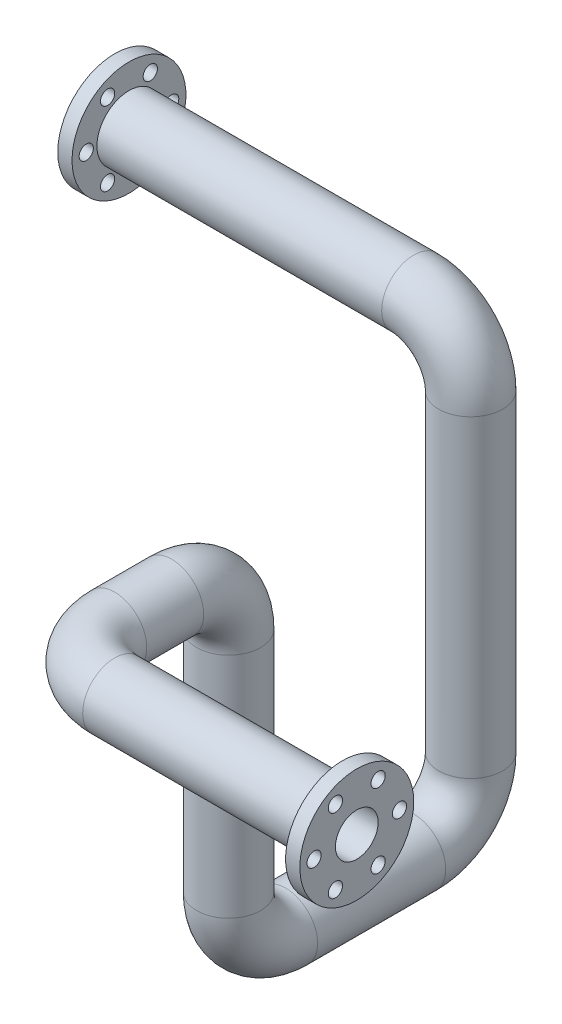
from build123d import *

# Parameters (mm, degrees)
SWEEP_THIN1_PROFILE_R   = 22.5
SWEEP_THIN1_PROFILE_R_2 = 15
BOSS_EXTRUDE1_START     = 10
SKETCH13_R              = 40
SKETCH13_R_2            = 15
BOSS_EXTRUDE1_DEPTH     = 10
SKETCH14_R              = 40
SKETCH14_R_2            = 15
BOSS_EXTRUDE2_DEPTH     = 10
CUT_EXTRUDE1_REACH      = 653.541
SKETCH15_R              = 5
CIRPATTERN1_COUNT       = 6
CUT_EXTRUDE2_REACH      = 653.541
SKETCH16_R              = 5
CIRPATTERN2_COUNT       = 6


with BuildPart() as part:
    # Sweep-Thin1: sweep along a curve in space
    with BuildLine() as sweep_thin1_path:
        Line((0, 0, 0), (200, 0, 0))
        ThreePointArc((200, 0, 0), (228.284271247, -11.715728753, 0), (240, -40, 0))
        Line((240, -40, 0), (240, -260, 0))
        ThreePointArc((240, -260, 0), (240, -288.284271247, 11.715728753), (240, -300, 40))
        Line((240, -300, 40), (240, -300, 130))
        ThreePointArc((240, -300, 130), (240, -288.284271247, 158.284271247), (240, -260, 170))
        Line((240, -260, 170), (240, -100, 170))
        ThreePointArc((240, -100, 170), (240, -71.715728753, 181.715728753), (240, -60, 210))
        Line((240, -60, 210), (240, -60, 250))
        ThreePointArc((240, -60, 250), (251.715728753, -60, 278.284271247), (280, -60, 290))
        Line((280, -60, 290), (440, -60, 290))
    # Sweep-Thin1 profile (on start of the path) → Sweep-Thin1 (sweep)
    with BuildSketch(Plane(origin=(0, 0, 0), x_dir=(0, 0, 1), z_dir=(1, 0, 0))):
        Circle(SWEEP_THIN1_PROFILE_R)
        Circle(SWEEP_THIN1_PROFILE_R_2, mode=Mode.SUBTRACT)
    sweep(path=sweep_thin1_path.line)

    # Sketch13 → Boss-Extrude1 (add)
    with BuildSketch(Plane(origin=(440, 0, 0), x_dir=(0, 0, -1), z_dir=(1, 0, 0)).offset(BOSS_EXTRUDE1_START)):
        with Locations((-290, -60)):
            Circle(SKETCH13_R)
        with Locations((-290, -60)):
            Circle(SKETCH13_R_2, mode=Mode.SUBTRACT)
    extrude(amount=-BOSS_EXTRUDE1_DEPTH)

    # Sketch14 → Boss-Extrude2 (add)
    with BuildSketch(Plane.ZY):
        Circle(SKETCH14_R)
        with Locations(Location((0, 0, 0), (0, 0, 90))):
            Circle(SKETCH14_R_2, mode=Mode.SUBTRACT)
    extrude(amount=BOSS_EXTRUDE2_DEPTH)

    # Sketch15 → Cut-Extrude1 (cut, up to next)
    with BuildSketch(Plane(origin=(450, 0, 0), x_dir=(0, 0, -1), z_dir=(1, 0, 0)), mode=Mode.PRIVATE) as cut_extrude1_sk1:
        with Locations((-260, -60)):
            Circle(SKETCH15_R)
    cut_extrude1_tool1 = extrude(cut_extrude1_sk1.sketch, amount=-CUT_EXTRUDE1_REACH, mode=Mode.PRIVATE) & part.part
    cut_extrude1 = cut_extrude1_tool1.solids().sort_by_distance((450, -60, 260))[0]
    add(cut_extrude1, mode=Mode.SUBTRACT)

    # CirPattern1: Cut-Extrude1 ×6 about axis
    cirpattern1_axis = Axis((0, -60, 290), (1, 0, 0))
    for i in range(1, CIRPATTERN1_COUNT):
        add(cut_extrude1.rotate(cirpattern1_axis, i * 360 / CIRPATTERN1_COUNT), mode=Mode.SUBTRACT)

    # Sketch16 → Cut-Extrude2 (cut, up to next)
    with BuildSketch(Plane.ZY.offset(10), mode=Mode.PRIVATE) as cut_extrude2_sk1:
        with Locations((30, 0)):
            Circle(SKETCH16_R)
    cut_extrude2_tool1 = extrude(cut_extrude2_sk1.sketch, amount=-CUT_EXTRUDE2_REACH, mode=Mode.PRIVATE) & part.part
    cut_extrude2 = cut_extrude2_tool1.solids().sort_by_distance((-10, 0, 30))[0]
    add(cut_extrude2, mode=Mode.SUBTRACT)

    # CirPattern2: Cut-Extrude2 ×6 about axis
    cirpattern2_axis = Axis((0, 0, 0), (1, 0, 0))
    for i in range(1, CIRPATTERN2_COUNT):
        add(cut_extrude2.rotate(cirpattern2_axis, i * 360 / CIRPATTERN2_COUNT), mode=Mode.SUBTRACT)


solid = part.part
